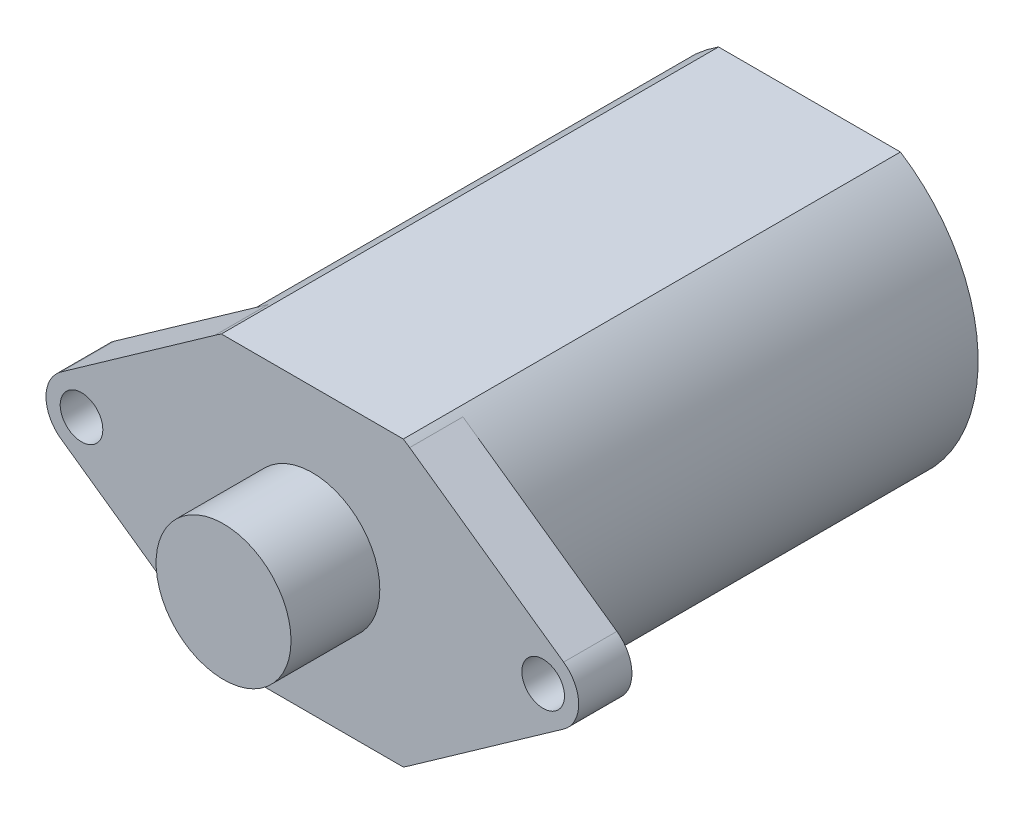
ISO-10303-21;
HEADER;
FILE_DESCRIPTION(('STEP AP214'),'2;1');
FILE_NAME('part.step','',(''),(''),'','','');
FILE_SCHEMA(('AUTOMOTIVE_DESIGN { 1 0 10303 214 1 1 1 1 }'));
ENDSEC;
DATA;
#1=APPLICATION_CONTEXT('core data for automotive mechanical design processes');
#2=APPLICATION_PROTOCOL_DEFINITION('international standard','automotive_design',2000,#1);
#3=PRODUCT_CONTEXT('',#1,'mechanical');
#4=PRODUCT('Part','Part','',(#3));
#5=PRODUCT_RELATED_PRODUCT_CATEGORY('part','',(#4));
#6=PRODUCT_DEFINITION_FORMATION('','',#4);
#7=PRODUCT_DEFINITION_CONTEXT('part definition',#1,'design');
#8=PRODUCT_DEFINITION('design','',#6,#7);
#9=PRODUCT_DEFINITION_SHAPE('','',#8);
#10=(LENGTH_UNIT() NAMED_UNIT(*) SI_UNIT(.MILLI.,.METRE.));
#11=(NAMED_UNIT(*) PLANE_ANGLE_UNIT() SI_UNIT($,.RADIAN.));
#12=(NAMED_UNIT(*) SI_UNIT($,.STERADIAN.) SOLID_ANGLE_UNIT());
#13=UNCERTAINTY_MEASURE_WITH_UNIT(LENGTH_MEASURE(1.E-05),#10,'distance_accuracy_value','');
#14=(GEOMETRIC_REPRESENTATION_CONTEXT(3) GLOBAL_UNCERTAINTY_ASSIGNED_CONTEXT((#13)) GLOBAL_UNIT_ASSIGNED_CONTEXT((#10,
#11,#12)) REPRESENTATION_CONTEXT('',''));
#15=CARTESIAN_POINT('',(0.,0.,0.));
#16=DIRECTION('',(0.,0.,1.));
#17=DIRECTION('',(1.,0.,0.));
#18=AXIS2_PLACEMENT_3D('',#15,#16,#17);
#19=CARTESIAN_POINT('',(0.,0.,140.));
#20=DIRECTION('',(0.,0.,1.));
#21=DIRECTION('',(1.,0.,0.));
#22=AXIS2_PLACEMENT_3D('',#19,#20,#21);
#23=PLANE('',#22);
#24=DIRECTION('',(1.,0.,0.));
#25=VECTOR('',#24,1.);
#26=CARTESIAN_POINT('',(25.617376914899,-40.,140.));
#27=LINE('',#26,#25);
#28=CARTESIAN_POINT('',(-25.617376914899,-40.,140.));
#29=VERTEX_POINT('',#28);
#30=CARTESIAN_POINT('',(25.617376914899,-40.,140.));
#31=VERTEX_POINT('',#30);
#32=EDGE_CURVE('E133',#29,#31,#27,.T.);
#33=ORIENTED_EDGE('',*,*,#32,.T.);
#34=CARTESIAN_POINT('',(0.,0.,140.));
#35=DIRECTION('',(0.,0.,1.));
#36=DIRECTION('',(1.,0.,0.));
#37=AXIS2_PLACEMENT_3D('',#34,#35,#36);
#38=CIRCLE('',#37,47.5);
#39=CARTESIAN_POINT('',(27.4038461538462,-38.7979279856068,140.));
#40=VERTEX_POINT('',#39);
#41=EDGE_CURVE('E48',#31,#40,#38,.T.);
#42=ORIENTED_EDGE('',*,*,#41,.T.);
#43=DIRECTION('',(0.816798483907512,0.576923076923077,0.));
#44=VECTOR('',#43,1.);
#45=CARTESIAN_POINT('',(27.4038461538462,-38.7979279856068,140.));
#46=LINE('',#45,#44);
#47=CARTESIAN_POINT('',(70.7692307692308,-8.16798483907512,140.));
#48=VERTEX_POINT('',#47);
#49=EDGE_CURVE('E208',#40,#48,#46,.T.);
#50=ORIENTED_EDGE('',*,*,#49,.T.);
#51=CARTESIAN_POINT('',(65.,0.,140.));
#52=DIRECTION('',(0.,0.,1.));
#53=DIRECTION('',(1.,0.,0.));
#54=AXIS2_PLACEMENT_3D('',#51,#52,#53);
#55=CIRCLE('',#54,10.);
#56=CARTESIAN_POINT('',(70.7692307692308,8.16798483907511,140.));
#57=VERTEX_POINT('',#56);
#58=EDGE_CURVE('E212',#48,#57,#55,.T.);
#59=ORIENTED_EDGE('',*,*,#58,.T.);
#60=DIRECTION('',(-0.816798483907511,0.576923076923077,0.));
#61=VECTOR('',#60,1.);
#62=CARTESIAN_POINT('',(70.7692307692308,8.16798483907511,140.));
#63=LINE('',#62,#61);
#64=CARTESIAN_POINT('',(27.4038461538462,38.7979279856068,140.));
#65=VERTEX_POINT('',#64);
#66=EDGE_CURVE('E210',#57,#65,#63,.T.);
#67=ORIENTED_EDGE('',*,*,#66,.T.);
#68=CARTESIAN_POINT('',(25.617376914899,40.,140.));
#69=VERTEX_POINT('',#68);
#70=EDGE_CURVE('E50',#65,#69,#38,.T.);
#71=ORIENTED_EDGE('',*,*,#70,.T.);
#72=DIRECTION('',(-1.,0.,0.));
#73=VECTOR('',#72,1.);
#74=CARTESIAN_POINT('',(25.617376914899,40.,140.));
#75=LINE('',#74,#73);
#76=CARTESIAN_POINT('',(-25.617376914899,40.,140.));
#77=VERTEX_POINT('',#76);
#78=EDGE_CURVE('E219',#69,#77,#75,.T.);
#79=ORIENTED_EDGE('',*,*,#78,.T.);
#80=CARTESIAN_POINT('',(-27.4038461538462,38.7979279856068,140.));
#81=VERTEX_POINT('',#80);
#82=EDGE_CURVE('E147',#77,#81,#38,.T.);
#83=ORIENTED_EDGE('',*,*,#82,.T.);
#84=DIRECTION('',(-0.816798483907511,-0.576923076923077,0.));
#85=VECTOR('',#84,1.);
#86=CARTESIAN_POINT('',(-70.7692307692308,8.16798483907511,140.));
#87=LINE('',#86,#85);
#88=CARTESIAN_POINT('',(-70.7692307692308,8.16798483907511,140.));
#89=VERTEX_POINT('',#88);
#90=EDGE_CURVE('E182',#81,#89,#87,.T.);
#91=ORIENTED_EDGE('',*,*,#90,.T.);
#92=CARTESIAN_POINT('',(-65.,0.,140.));
#93=DIRECTION('',(0.,0.,1.));
#94=DIRECTION('',(1.,0.,0.));
#95=AXIS2_PLACEMENT_3D('',#92,#93,#94);
#96=CIRCLE('',#95,10.);
#97=CARTESIAN_POINT('',(-70.7692307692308,-8.16798483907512,140.));
#98=VERTEX_POINT('',#97);
#99=EDGE_CURVE('E186',#89,#98,#96,.T.);
#100=ORIENTED_EDGE('',*,*,#99,.T.);
#101=DIRECTION('',(0.816798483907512,-0.576923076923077,0.));
#102=VECTOR('',#101,1.);
#103=CARTESIAN_POINT('',(-70.7692307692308,-8.16798483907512,140.));
#104=LINE('',#103,#102);
#105=CARTESIAN_POINT('',(-27.4038461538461,-38.7979279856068,140.));
#106=VERTEX_POINT('',#105);
#107=EDGE_CURVE('E184',#98,#106,#104,.T.);
#108=ORIENTED_EDGE('',*,*,#107,.T.);
#109=EDGE_CURVE('E11',#106,#29,#38,.T.);
#110=ORIENTED_EDGE('',*,*,#109,.T.);
#111=EDGE_LOOP('',(#33,#42,#50,#59,#67,#71,#79,#83,#91,#100,#108,#110));
#112=FACE_BOUND('',#111,.T.);
#113=CARTESIAN_POINT('',(-65.,0.,140.));
#114=DIRECTION('',(0.,0.,1.));
#115=DIRECTION('',(1.,0.,0.));
#116=AXIS2_PLACEMENT_3D('',#113,#114,#115);
#117=CIRCLE('',#116,6.);
#118=CARTESIAN_POINT('',(-59.,0.,140.));
#119=VERTEX_POINT('',#118);
#120=EDGE_CURVE('E226',#119,#119,#117,.T.);
#121=ORIENTED_EDGE('',*,*,#120,.F.);
#122=EDGE_LOOP('',(#121));
#123=FACE_BOUND('',#122,.T.);
#124=CARTESIAN_POINT('',(65.,0.,140.));
#125=DIRECTION('',(0.,0.,1.));
#126=DIRECTION('',(1.,0.,0.));
#127=AXIS2_PLACEMENT_3D('',#124,#125,#126);
#128=CIRCLE('',#127,6.);
#129=CARTESIAN_POINT('',(71.,0.,140.));
#130=VERTEX_POINT('',#129);
#131=EDGE_CURVE('E229',#130,#130,#128,.T.);
#132=ORIENTED_EDGE('',*,*,#131,.F.);
#133=EDGE_LOOP('',(#132));
#134=FACE_BOUND('',#133,.T.);
#135=CARTESIAN_POINT('',(0.,0.,140.));
#136=DIRECTION('',(0.,0.,1.));
#137=DIRECTION('',(1.,0.,0.));
#138=AXIS2_PLACEMENT_3D('',#135,#136,#137);
#139=CIRCLE('',#138,19.);
#140=CARTESIAN_POINT('',(19.,0.,140.));
#141=VERTEX_POINT('',#140);
#142=EDGE_CURVE('E235',#141,#141,#139,.T.);
#143=ORIENTED_EDGE('',*,*,#142,.F.);
#144=EDGE_LOOP('',(#143));
#145=FACE_BOUND('',#144,.T.);
#146=ADVANCED_FACE('F39',(#112,#123,#134,#145),#23,.T.);
#147=CARTESIAN_POINT('',(0.,0.,140.));
#148=DIRECTION('',(0.,0.,-1.));
#149=DIRECTION('',(-1.,0.,0.));
#150=AXIS2_PLACEMENT_3D('',#147,#148,#149);
#151=CYLINDRICAL_SURFACE('',#150,47.5);
#152=ORIENTED_EDGE('',*,*,#41,.F.);
#153=DIRECTION('',(0.,0.,-1.));
#154=VECTOR('',#153,1.);
#155=CARTESIAN_POINT('',(25.617376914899,-40.,191.78078794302));
#156=LINE('',#155,#154);
#157=CARTESIAN_POINT('',(25.617376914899,-40.,0.));
#158=VERTEX_POINT('',#157);
#159=EDGE_CURVE('E130',#31,#158,#156,.T.);
#160=ORIENTED_EDGE('',*,*,#159,.T.);
#161=CARTESIAN_POINT('',(0.,0.,0.));
#162=DIRECTION('',(0.,0.,1.));
#163=DIRECTION('',(1.,0.,0.));
#164=AXIS2_PLACEMENT_3D('',#161,#162,#163);
#165=CIRCLE('',#164,47.5);
#166=CARTESIAN_POINT('',(25.617376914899,40.,0.));
#167=VERTEX_POINT('',#166);
#168=EDGE_CURVE('E65',#158,#167,#165,.T.);
#169=ORIENTED_EDGE('',*,*,#168,.T.);
#170=DIRECTION('',(0.,0.,-1.));
#171=VECTOR('',#170,1.);
#172=CARTESIAN_POINT('',(25.617376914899,40.,191.78078794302));
#173=LINE('',#172,#171);
#174=EDGE_CURVE('E215',#69,#167,#173,.T.);
#175=ORIENTED_EDGE('',*,*,#174,.F.);
#176=ORIENTED_EDGE('',*,*,#70,.F.);
#177=DIRECTION('',(0.,0.,1.));
#178=VECTOR('',#177,1.);
#179=CARTESIAN_POINT('',(27.4038461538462,38.7979279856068,125.));
#180=LINE('',#179,#178);
#181=CARTESIAN_POINT('',(27.4038461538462,38.7979279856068,125.));
#182=VERTEX_POINT('',#181);
#183=EDGE_CURVE('E192',#182,#65,#180,.T.);
#184=ORIENTED_EDGE('',*,*,#183,.F.);
#185=CARTESIAN_POINT('',(0.,0.,125.));
#186=DIRECTION('',(0.,0.,-1.));
#187=DIRECTION('',(1.,0.,0.));
#188=AXIS2_PLACEMENT_3D('',#185,#186,#187);
#189=CIRCLE('',#188,47.5);
#190=CARTESIAN_POINT('',(27.4038461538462,-38.7979279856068,125.));
#191=VERTEX_POINT('',#190);
#192=EDGE_CURVE('E200',#182,#191,#189,.T.);
#193=ORIENTED_EDGE('',*,*,#192,.T.);
#194=DIRECTION('',(0.,0.,1.));
#195=VECTOR('',#194,1.);
#196=CARTESIAN_POINT('',(27.4038461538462,-38.7979279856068,125.));
#197=LINE('',#196,#195);
#198=EDGE_CURVE('E146',#191,#40,#197,.T.);
#199=ORIENTED_EDGE('',*,*,#198,.T.);
#200=EDGE_LOOP('',(#152,#160,#169,#175,#176,#184,#193,#199));
#201=FACE_BOUND('',#200,.T.);
#202=ADVANCED_FACE('F144',(#201),#151,.T.);
#203=CARTESIAN_POINT('',(-25.617376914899,40.,0.));
#204=VERTEX_POINT('',#203);
#205=CARTESIAN_POINT('',(-25.617376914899,-40.,0.));
#206=VERTEX_POINT('',#205);
#207=EDGE_CURVE('E150',#204,#206,#165,.T.);
#208=ORIENTED_EDGE('',*,*,#207,.T.);
#209=DIRECTION('',(0.,0.,-1.));
#210=VECTOR('',#209,1.);
#211=CARTESIAN_POINT('',(-25.617376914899,-40.,191.78078794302));
#212=LINE('',#211,#210);
#213=EDGE_CURVE('E57',#29,#206,#212,.T.);
#214=ORIENTED_EDGE('',*,*,#213,.F.);
#215=ORIENTED_EDGE('',*,*,#109,.F.);
#216=DIRECTION('',(0.,0.,1.));
#217=VECTOR('',#216,1.);
#218=CARTESIAN_POINT('',(-27.4038461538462,-38.7979279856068,125.));
#219=LINE('',#218,#217);
#220=CARTESIAN_POINT('',(-27.4038461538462,-38.7979279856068,125.));
#221=VERTEX_POINT('',#220);
#222=EDGE_CURVE('E163',#221,#106,#219,.T.);
#223=ORIENTED_EDGE('',*,*,#222,.F.);
#224=CARTESIAN_POINT('',(0.,0.,125.));
#225=DIRECTION('',(0.,0.,-1.));
#226=DIRECTION('',(1.,0.,0.));
#227=AXIS2_PLACEMENT_3D('',#224,#225,#226);
#228=CIRCLE('',#227,47.5);
#229=CARTESIAN_POINT('',(-27.4038461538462,38.7979279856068,125.));
#230=VERTEX_POINT('',#229);
#231=EDGE_CURVE('E173',#221,#230,#228,.T.);
#232=ORIENTED_EDGE('',*,*,#231,.T.);
#233=DIRECTION('',(0.,0.,1.));
#234=VECTOR('',#233,1.);
#235=CARTESIAN_POINT('',(-27.4038461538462,38.7979279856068,125.));
#236=LINE('',#235,#234);
#237=EDGE_CURVE('E167',#230,#81,#236,.T.);
#238=ORIENTED_EDGE('',*,*,#237,.T.);
#239=ORIENTED_EDGE('',*,*,#82,.F.);
#240=DIRECTION('',(0.,0.,-1.));
#241=VECTOR('',#240,1.);
#242=CARTESIAN_POINT('',(-25.617376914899,40.,191.78078794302));
#243=LINE('',#242,#241);
#244=EDGE_CURVE('E217',#77,#204,#243,.T.);
#245=ORIENTED_EDGE('',*,*,#244,.T.);
#246=EDGE_LOOP('',(#208,#214,#215,#223,#232,#238,#239,#245));
#247=FACE_BOUND('',#246,.T.);
#248=ADVANCED_FACE('F41',(#247),#151,.T.);
#249=CARTESIAN_POINT('',(0.,0.,0.));
#250=DIRECTION('',(0.,0.,1.));
#251=DIRECTION('',(1.,0.,0.));
#252=AXIS2_PLACEMENT_3D('',#249,#250,#251);
#253=PLANE('',#252);
#254=ORIENTED_EDGE('',*,*,#168,.F.);
#255=DIRECTION('',(1.,0.,0.));
#256=VECTOR('',#255,1.);
#257=CARTESIAN_POINT('',(25.617376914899,-40.,0.));
#258=LINE('',#257,#256);
#259=EDGE_CURVE('E134',#206,#158,#258,.T.);
#260=ORIENTED_EDGE('',*,*,#259,.F.);
#261=ORIENTED_EDGE('',*,*,#207,.F.);
#262=DIRECTION('',(-1.,0.,0.));
#263=VECTOR('',#262,1.);
#264=CARTESIAN_POINT('',(25.617376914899,40.,0.));
#265=LINE('',#264,#263);
#266=EDGE_CURVE('E221',#167,#204,#265,.T.);
#267=ORIENTED_EDGE('',*,*,#266,.F.);
#268=EDGE_LOOP('',(#254,#260,#261,#267));
#269=FACE_BOUND('',#268,.T.);
#270=ADVANCED_FACE('F248',(#269),#253,.F.);
#271=CARTESIAN_POINT('',(-65.,0.,125.));
#272=DIRECTION('',(0.,0.,1.));
#273=DIRECTION('',(1.,0.,0.));
#274=AXIS2_PLACEMENT_3D('',#271,#272,#273);
#275=CYLINDRICAL_SURFACE('',#274,10.);
#276=ORIENTED_EDGE('',*,*,#99,.F.);
#277=DIRECTION('',(0.,0.,1.));
#278=VECTOR('',#277,1.);
#279=CARTESIAN_POINT('',(-70.7692307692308,8.16798483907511,125.));
#280=LINE('',#279,#278);
#281=CARTESIAN_POINT('',(-70.7692307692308,8.16798483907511,125.));
#282=VERTEX_POINT('',#281);
#283=EDGE_CURVE('E159',#282,#89,#280,.T.);
#284=ORIENTED_EDGE('',*,*,#283,.F.);
#285=CARTESIAN_POINT('',(-65.,0.,125.));
#286=DIRECTION('',(0.,0.,1.));
#287=DIRECTION('',(1.,0.,0.));
#288=AXIS2_PLACEMENT_3D('',#285,#286,#287);
#289=CIRCLE('',#288,10.);
#290=CARTESIAN_POINT('',(-70.7692307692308,-8.16798483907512,125.));
#291=VERTEX_POINT('',#290);
#292=EDGE_CURVE('E179',#282,#291,#289,.T.);
#293=ORIENTED_EDGE('',*,*,#292,.T.);
#294=DIRECTION('',(0.,0.,1.));
#295=VECTOR('',#294,1.);
#296=CARTESIAN_POINT('',(-70.7692307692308,-8.16798483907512,125.));
#297=LINE('',#296,#295);
#298=EDGE_CURVE('E161',#291,#98,#297,.T.);
#299=ORIENTED_EDGE('',*,*,#298,.T.);
#300=EDGE_LOOP('',(#276,#284,#293,#299));
#301=FACE_BOUND('',#300,.T.);
#302=ADVANCED_FACE('F251',(#301),#275,.T.);
#303=CARTESIAN_POINT('',(-70.7692307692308,8.16798483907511,125.));
#304=DIRECTION('',(-0.576923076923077,0.816798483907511,0.));
#305=DIRECTION('',(-0.816798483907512,-0.576923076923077,0.));
#306=AXIS2_PLACEMENT_3D('',#303,#304,#305);
#307=PLANE('',#306);
#308=ORIENTED_EDGE('',*,*,#90,.F.);
#309=ORIENTED_EDGE('',*,*,#237,.F.);
#310=DIRECTION('',(-0.816798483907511,-0.576923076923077,0.));
#311=VECTOR('',#310,1.);
#312=CARTESIAN_POINT('',(-70.7692307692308,8.16798483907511,125.));
#313=LINE('',#312,#311);
#314=EDGE_CURVE('E164',#230,#282,#313,.T.);
#315=ORIENTED_EDGE('',*,*,#314,.T.);
#316=ORIENTED_EDGE('',*,*,#283,.T.);
#317=EDGE_LOOP('',(#308,#309,#315,#316));
#318=FACE_BOUND('',#317,.T.);
#319=ADVANCED_FACE('F255',(#318),#307,.T.);
#320=CARTESIAN_POINT('',(-70.7692307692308,-8.16798483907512,125.));
#321=DIRECTION('',(-0.576923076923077,-0.816798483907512,0.));
#322=DIRECTION('',(0.816798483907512,-0.576923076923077,0.));
#323=AXIS2_PLACEMENT_3D('',#320,#321,#322);
#324=PLANE('',#323);
#325=ORIENTED_EDGE('',*,*,#107,.F.);
#326=ORIENTED_EDGE('',*,*,#298,.F.);
#327=DIRECTION('',(0.816798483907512,-0.576923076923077,0.));
#328=VECTOR('',#327,1.);
#329=CARTESIAN_POINT('',(-70.7692307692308,-8.16798483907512,125.));
#330=LINE('',#329,#328);
#331=EDGE_CURVE('E176',#291,#221,#330,.T.);
#332=ORIENTED_EDGE('',*,*,#331,.T.);
#333=ORIENTED_EDGE('',*,*,#222,.T.);
#334=EDGE_LOOP('',(#325,#326,#332,#333));
#335=FACE_BOUND('',#334,.T.);
#336=ADVANCED_FACE('F257',(#335),#324,.T.);
#337=CARTESIAN_POINT('',(-65.,0.,125.));
#338=DIRECTION('',(0.,0.,1.));
#339=DIRECTION('',(1.,0.,0.));
#340=AXIS2_PLACEMENT_3D('',#337,#338,#339);
#341=PLANE('',#340);
#342=CARTESIAN_POINT('',(-65.,0.,125.));
#343=DIRECTION('',(0.,0.,1.));
#344=DIRECTION('',(1.,0.,0.));
#345=AXIS2_PLACEMENT_3D('',#342,#343,#344);
#346=CIRCLE('',#345,6.);
#347=CARTESIAN_POINT('',(-59.,0.,125.));
#348=VERTEX_POINT('',#347);
#349=EDGE_CURVE('E225',#348,#348,#346,.T.);
#350=ORIENTED_EDGE('',*,*,#349,.T.);
#351=EDGE_LOOP('',(#350));
#352=FACE_BOUND('',#351,.T.);
#353=ORIENTED_EDGE('',*,*,#292,.F.);
#354=ORIENTED_EDGE('',*,*,#314,.F.);
#355=ORIENTED_EDGE('',*,*,#231,.F.);
#356=ORIENTED_EDGE('',*,*,#331,.F.);
#357=EDGE_LOOP('',(#353,#354,#355,#356));
#358=FACE_BOUND('',#357,.T.);
#359=ADVANCED_FACE('F260',(#352,#358),#341,.F.);
#360=CARTESIAN_POINT('',(65.,0.,125.));
#361=DIRECTION('',(0.,0.,1.));
#362=DIRECTION('',(1.,0.,0.));
#363=AXIS2_PLACEMENT_3D('',#360,#361,#362);
#364=CYLINDRICAL_SURFACE('',#363,10.);
#365=ORIENTED_EDGE('',*,*,#58,.F.);
#366=DIRECTION('',(0.,0.,1.));
#367=VECTOR('',#366,1.);
#368=CARTESIAN_POINT('',(70.7692307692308,-8.16798483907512,125.));
#369=LINE('',#368,#367);
#370=CARTESIAN_POINT('',(70.7692307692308,-8.16798483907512,125.));
#371=VERTEX_POINT('',#370);
#372=EDGE_CURVE('E189',#371,#48,#369,.T.);
#373=ORIENTED_EDGE('',*,*,#372,.F.);
#374=CARTESIAN_POINT('',(65.,0.,125.));
#375=DIRECTION('',(0.,0.,1.));
#376=DIRECTION('',(1.,0.,0.));
#377=AXIS2_PLACEMENT_3D('',#374,#375,#376);
#378=CIRCLE('',#377,10.);
#379=CARTESIAN_POINT('',(70.7692307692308,8.16798483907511,125.));
#380=VERTEX_POINT('',#379);
#381=EDGE_CURVE('E205',#371,#380,#378,.T.);
#382=ORIENTED_EDGE('',*,*,#381,.T.);
#383=DIRECTION('',(0.,0.,1.));
#384=VECTOR('',#383,1.);
#385=CARTESIAN_POINT('',(70.7692307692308,8.16798483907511,125.));
#386=LINE('',#385,#384);
#387=EDGE_CURVE('E190',#380,#57,#386,.T.);
#388=ORIENTED_EDGE('',*,*,#387,.T.);
#389=EDGE_LOOP('',(#365,#373,#382,#388));
#390=FACE_BOUND('',#389,.T.);
#391=ADVANCED_FACE('F267',(#390),#364,.T.);
#392=CARTESIAN_POINT('',(27.4038461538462,-38.7979279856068,125.));
#393=DIRECTION('',(0.576923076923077,-0.816798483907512,0.));
#394=DIRECTION('',(0.816798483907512,0.576923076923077,0.));
#395=AXIS2_PLACEMENT_3D('',#392,#393,#394);
#396=PLANE('',#395);
#397=ORIENTED_EDGE('',*,*,#49,.F.);
#398=ORIENTED_EDGE('',*,*,#198,.F.);
#399=DIRECTION('',(0.816798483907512,0.576923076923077,0.));
#400=VECTOR('',#399,1.);
#401=CARTESIAN_POINT('',(27.4038461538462,-38.7979279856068,125.));
#402=LINE('',#401,#400);
#403=EDGE_CURVE('E193',#191,#371,#402,.T.);
#404=ORIENTED_EDGE('',*,*,#403,.T.);
#405=ORIENTED_EDGE('',*,*,#372,.T.);
#406=EDGE_LOOP('',(#397,#398,#404,#405));
#407=FACE_BOUND('',#406,.T.);
#408=ADVANCED_FACE('F271',(#407),#396,.T.);
#409=CARTESIAN_POINT('',(70.7692307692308,8.16798483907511,125.));
#410=DIRECTION('',(0.576923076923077,0.816798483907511,0.));
#411=DIRECTION('',(-0.816798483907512,0.576923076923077,0.));
#412=AXIS2_PLACEMENT_3D('',#409,#410,#411);
#413=PLANE('',#412);
#414=ORIENTED_EDGE('',*,*,#66,.F.);
#415=ORIENTED_EDGE('',*,*,#387,.F.);
#416=DIRECTION('',(-0.816798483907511,0.576923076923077,0.));
#417=VECTOR('',#416,1.);
#418=CARTESIAN_POINT('',(70.7692307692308,8.16798483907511,125.));
#419=LINE('',#418,#417);
#420=EDGE_CURVE('E202',#380,#182,#419,.T.);
#421=ORIENTED_EDGE('',*,*,#420,.T.);
#422=ORIENTED_EDGE('',*,*,#183,.T.);
#423=EDGE_LOOP('',(#414,#415,#421,#422));
#424=FACE_BOUND('',#423,.T.);
#425=ADVANCED_FACE('F273',(#424),#413,.T.);
#426=CARTESIAN_POINT('',(65.,0.,125.));
#427=DIRECTION('',(0.,0.,1.));
#428=DIRECTION('',(1.,0.,0.));
#429=AXIS2_PLACEMENT_3D('',#426,#427,#428);
#430=PLANE('',#429);
#431=CARTESIAN_POINT('',(65.,0.,125.));
#432=DIRECTION('',(0.,0.,1.));
#433=DIRECTION('',(1.,0.,0.));
#434=AXIS2_PLACEMENT_3D('',#431,#432,#433);
#435=CIRCLE('',#434,6.);
#436=CARTESIAN_POINT('',(71.,0.,125.));
#437=VERTEX_POINT('',#436);
#438=EDGE_CURVE('E43',#437,#437,#435,.T.);
#439=ORIENTED_EDGE('',*,*,#438,.T.);
#440=EDGE_LOOP('',(#439));
#441=FACE_BOUND('',#440,.T.);
#442=ORIENTED_EDGE('',*,*,#381,.F.);
#443=ORIENTED_EDGE('',*,*,#403,.F.);
#444=ORIENTED_EDGE('',*,*,#192,.F.);
#445=ORIENTED_EDGE('',*,*,#420,.F.);
#446=EDGE_LOOP('',(#442,#443,#444,#445));
#447=FACE_BOUND('',#446,.T.);
#448=ADVANCED_FACE('F276',(#441,#447),#430,.F.);
#449=CARTESIAN_POINT('',(25.617376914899,40.,191.78078794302));
#450=DIRECTION('',(0.,-1.,0.));
#451=DIRECTION('',(0.,0.,-1.));
#452=AXIS2_PLACEMENT_3D('',#449,#450,#451);
#453=PLANE('',#452);
#454=ORIENTED_EDGE('',*,*,#174,.T.);
#455=ORIENTED_EDGE('',*,*,#266,.T.);
#456=ORIENTED_EDGE('',*,*,#244,.F.);
#457=ORIENTED_EDGE('',*,*,#78,.F.);
#458=EDGE_LOOP('',(#454,#455,#456,#457));
#459=FACE_BOUND('',#458,.T.);
#460=ADVANCED_FACE('F283',(#459),#453,.F.);
#461=CARTESIAN_POINT('',(25.617376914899,-40.,191.78078794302));
#462=DIRECTION('',(0.,1.,0.));
#463=DIRECTION('',(0.,0.,1.));
#464=AXIS2_PLACEMENT_3D('',#461,#462,#463);
#465=PLANE('',#464);
#466=ORIENTED_EDGE('',*,*,#213,.T.);
#467=ORIENTED_EDGE('',*,*,#259,.T.);
#468=ORIENTED_EDGE('',*,*,#159,.F.);
#469=ORIENTED_EDGE('',*,*,#32,.F.);
#470=EDGE_LOOP('',(#466,#467,#468,#469));
#471=FACE_BOUND('',#470,.T.);
#472=ADVANCED_FACE('F132',(#471),#465,.F.);
#473=CARTESIAN_POINT('',(-65.,0.,0.));
#474=DIRECTION('',(0.,0.,1.));
#475=DIRECTION('',(1.,0.,0.));
#476=AXIS2_PLACEMENT_3D('',#473,#474,#475);
#477=CYLINDRICAL_SURFACE('',#476,6.);
#478=ORIENTED_EDGE('',*,*,#120,.T.);
#479=EDGE_LOOP('',(#478));
#480=FACE_BOUND('',#479,.T.);
#481=ORIENTED_EDGE('',*,*,#349,.F.);
#482=EDGE_LOOP('',(#481));
#483=FACE_BOUND('',#482,.T.);
#484=ADVANCED_FACE('F290',(#480,#483),#477,.F.);
#485=CARTESIAN_POINT('',(65.,0.,0.));
#486=DIRECTION('',(0.,0.,1.));
#487=DIRECTION('',(1.,0.,0.));
#488=AXIS2_PLACEMENT_3D('',#485,#486,#487);
#489=CYLINDRICAL_SURFACE('',#488,6.);
#490=ORIENTED_EDGE('',*,*,#131,.T.);
#491=EDGE_LOOP('',(#490));
#492=FACE_BOUND('',#491,.T.);
#493=ORIENTED_EDGE('',*,*,#438,.F.);
#494=EDGE_LOOP('',(#493));
#495=FACE_BOUND('',#494,.T.);
#496=ADVANCED_FACE('F293',(#492,#495),#489,.F.);
#497=CARTESIAN_POINT('',(0.,0.,165.));
#498=DIRECTION('',(0.,0.,-1.));
#499=DIRECTION('',(-1.,0.,0.));
#500=AXIS2_PLACEMENT_3D('',#497,#498,#499);
#501=CYLINDRICAL_SURFACE('',#500,19.);
#502=CARTESIAN_POINT('',(0.,0.,165.));
#503=DIRECTION('',(0.,0.,1.));
#504=DIRECTION('',(1.,0.,0.));
#505=AXIS2_PLACEMENT_3D('',#502,#503,#504);
#506=CIRCLE('',#505,19.);
#507=CARTESIAN_POINT('',(19.,0.,165.));
#508=VERTEX_POINT('',#507);
#509=EDGE_CURVE('E232',#508,#508,#506,.T.);
#510=ORIENTED_EDGE('',*,*,#509,.F.);
#511=EDGE_LOOP('',(#510));
#512=FACE_BOUND('',#511,.T.);
#513=ORIENTED_EDGE('',*,*,#142,.T.);
#514=EDGE_LOOP('',(#513));
#515=FACE_BOUND('',#514,.T.);
#516=ADVANCED_FACE('F239',(#512,#515),#501,.T.);
#517=CARTESIAN_POINT('',(0.,0.,165.));
#518=DIRECTION('',(0.,0.,1.));
#519=DIRECTION('',(1.,0.,0.));
#520=AXIS2_PLACEMENT_3D('',#517,#518,#519);
#521=PLANE('',#520);
#522=ORIENTED_EDGE('',*,*,#509,.T.);
#523=EDGE_LOOP('',(#522));
#524=FACE_BOUND('',#523,.T.);
#525=ADVANCED_FACE('F298',(#524),#521,.T.);
#526=CLOSED_SHELL('',(#146,#202,#248,#270,#302,#319,#336,#359,#391,#408,#425,#448,#460,#472,
#484,#496,#516,#525));
#527=MANIFOLD_SOLID_BREP('B2',#526);
#528=ADVANCED_BREP_SHAPE_REPRESENTATION('',(#18,#527),#14);
#529=SHAPE_DEFINITION_REPRESENTATION(#9,#528);
ENDSEC;
END-ISO-10303-21;
